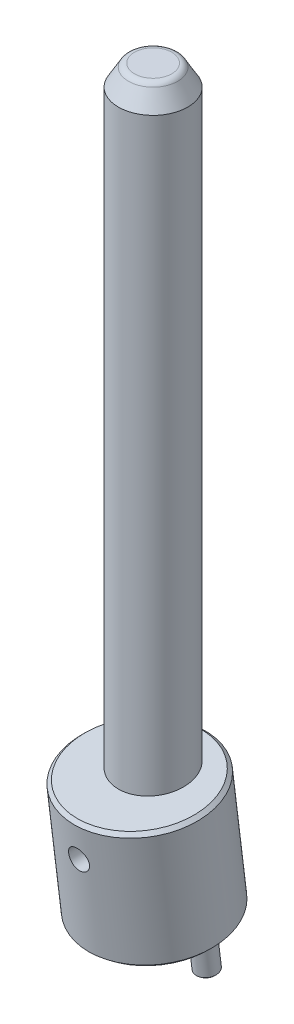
ISO-10303-21;
HEADER;
FILE_DESCRIPTION(('STEP AP214'),'2;1');
FILE_NAME('part.step','',(''),(''),'','','');
FILE_SCHEMA(('AUTOMOTIVE_DESIGN { 1 0 10303 214 1 1 1 1 }'));
ENDSEC;
DATA;
#1=APPLICATION_CONTEXT('core data for automotive mechanical design processes');
#2=APPLICATION_PROTOCOL_DEFINITION('international standard','automotive_design',2000,#1);
#3=PRODUCT_CONTEXT('',#1,'mechanical');
#4=PRODUCT('Part','Part','',(#3));
#5=PRODUCT_RELATED_PRODUCT_CATEGORY('part','',(#4));
#6=PRODUCT_DEFINITION_FORMATION('','',#4);
#7=PRODUCT_DEFINITION_CONTEXT('part definition',#1,'design');
#8=PRODUCT_DEFINITION('design','',#6,#7);
#9=PRODUCT_DEFINITION_SHAPE('','',#8);
#10=(LENGTH_UNIT() NAMED_UNIT(*) SI_UNIT(.MILLI.,.METRE.));
#11=(NAMED_UNIT(*) PLANE_ANGLE_UNIT() SI_UNIT($,.RADIAN.));
#12=(NAMED_UNIT(*) SI_UNIT($,.STERADIAN.) SOLID_ANGLE_UNIT());
#13=UNCERTAINTY_MEASURE_WITH_UNIT(LENGTH_MEASURE(1.E-05),#10,'distance_accuracy_value','');
#14=(GEOMETRIC_REPRESENTATION_CONTEXT(3) GLOBAL_UNCERTAINTY_ASSIGNED_CONTEXT((#13)) GLOBAL_UNIT_ASSIGNED_CONTEXT((#10,
#11,#12)) REPRESENTATION_CONTEXT('',''));
#15=CARTESIAN_POINT('',(0.,0.,0.));
#16=DIRECTION('',(0.,0.,1.));
#17=DIRECTION('',(1.,0.,0.));
#18=AXIS2_PLACEMENT_3D('',#15,#16,#17);
#19=CARTESIAN_POINT('',(0.,205.,0.));
#20=DIRECTION('',(0.,1.,0.));
#21=DIRECTION('',(-1.,0.,0.));
#22=AXIS2_PLACEMENT_3D('',#19,#20,#21);
#23=PLANE('',#22);
#24=CARTESIAN_POINT('',(0.,205.,0.));
#25=DIRECTION('',(0.,-1.,0.));
#26=DIRECTION('',(0.,0.,-1.));
#27=AXIS2_PLACEMENT_3D('',#24,#25,#26);
#28=CIRCLE('',#27,5.381197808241);
#29=CARTESIAN_POINT('',(0.,205.,-5.3811978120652));
#30=VERTEX_POINT('',#29);
#31=CARTESIAN_POINT('',(0.,205.,5.3811978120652));
#32=VERTEX_POINT('',#31);
#33=EDGE_CURVE('P0_E38',#30,#32,#28,.T.);
#34=ORIENTED_EDGE('',*,*,#33,.F.);
#35=CARTESIAN_POINT('',(0.,205.,0.));
#36=DIRECTION('',(0.,-1.,0.));
#37=DIRECTION('',(0.,0.,1.));
#38=AXIS2_PLACEMENT_3D('',#35,#36,#37);
#39=CIRCLE('',#38,5.381197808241);
#40=EDGE_CURVE('P0_E42',#32,#30,#39,.T.);
#41=ORIENTED_EDGE('',*,*,#40,.F.);
#42=EDGE_LOOP('',(#34,#41));
#43=FACE_BOUND('',#42,.T.);
#44=ADVANCED_FACE('P0_F17',(#43),#23,.T.);
#45=CARTESIAN_POINT('',(0.,203.,0.));
#46=DIRECTION('',(0.,1.,0.));
#47=DIRECTION('',(0.00894115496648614,0.,0.999960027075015));
#48=AXIS2_PLACEMENT_3D('',#45,#46,#47);
#49=TOROIDAL_SURFACE('',#48,5.381197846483,2.);
#50=ORIENTED_EDGE('',*,*,#33,.T.);
#51=ORIENTED_EDGE('',*,*,#40,.T.);
#52=EDGE_LOOP('',(#50,#51));
#53=FACE_BOUND('',#52,.T.);
#54=CARTESIAN_POINT('',(0.,204.00000003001,0.));
#55=DIRECTION('',(0.,-1.,0.));
#56=DIRECTION('',(0.,0.,1.));
#57=AXIS2_PLACEMENT_3D('',#54,#55,#56);
#58=CIRCLE('',#57,7.11324863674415);
#59=CARTESIAN_POINT('',(0.,204.00000003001,7.11324863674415));
#60=VERTEX_POINT('',#59);
#61=EDGE_CURVE('P0_E48',#60,#60,#58,.T.);
#62=ORIENTED_EDGE('',*,*,#61,.F.);
#63=EDGE_LOOP('',(#62));
#64=FACE_BOUND('',#63,.T.);
#65=ADVANCED_FACE('P0_F40',(#53,#64),#49,.T.);
#66=CARTESIAN_POINT('',(0.,0.,0.));
#67=DIRECTION('',(0.,1.,0.));
#68=DIRECTION('',(-1.,0.,0.));
#69=AXIS2_PLACEMENT_3D('',#66,#67,#68);
#70=PLANE('',#69);
#71=CARTESIAN_POINT('',(0.,-1.88036588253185E-07,0.));
#72=DIRECTION('',(0.,1.,0.));
#73=DIRECTION('',(-1.,0.,0.));
#74=AXIS2_PLACEMENT_3D('',#71,#72,#73);
#75=CIRCLE('',#74,8.99999984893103);
#76=CARTESIAN_POINT('',(-8.99999984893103,-1.88036588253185E-07,0.));
#77=VERTEX_POINT('',#76);
#78=EDGE_CURVE('P0_E85',#77,#77,#75,.T.);
#79=ORIENTED_EDGE('',*,*,#78,.F.);
#80=EDGE_LOOP('',(#79));
#81=FACE_BOUND('',#80,.T.);
#82=ADVANCED_FACE('P0_F76',(#81),#70,.F.);
#83=CARTESIAN_POINT('',(0.,17.,3.73205080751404));
#84=DIRECTION('',(0.,0.,1.));
#85=DIRECTION('',(-1.,0.,0.));
#86=AXIS2_PLACEMENT_3D('',#83,#84,#85);
#87=CONICAL_SURFACE('',#86,2.99999999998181,1.04719755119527);
#88=CARTESIAN_POINT('',(0.,16.9999999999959,1.99999999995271));
#89=VERTEX_POINT('',#88);
#90=VERTEX_LOOP('',#89);
#91=FACE_BOUND('',#90,.T.);
#92=CARTESIAN_POINT('',(0.,17.,3.732050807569));
#93=DIRECTION('',(0.,0.,1.));
#94=DIRECTION('',(0.,-1.,0.));
#95=AXIS2_PLACEMENT_3D('',#92,#93,#94);
#96=CIRCLE('',#95,3.);
#97=CARTESIAN_POINT('',(0.,14.,3.732050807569));
#98=VERTEX_POINT('',#97);
#99=EDGE_CURVE('P0_E82',#98,#98,#96,.T.);
#100=ORIENTED_EDGE('',*,*,#99,.T.);
#101=EDGE_LOOP('',(#100));
#102=FACE_BOUND('',#101,.T.);
#103=ADVANCED_FACE('P0_F116',(#91,#102),#87,.F.);
#104=CARTESIAN_POINT('',(0.,199.000000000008,0.));
#105=DIRECTION('',(0.,-1.,0.));
#106=DIRECTION('',(1.,0.,0.));
#107=AXIS2_PLACEMENT_3D('',#104,#105,#106);
#108=CONICAL_SURFACE('',#107,10.0000000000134,0.5235987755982);
#109=CARTESIAN_POINT('',(0.,199.,0.));
#110=DIRECTION('',(0.,1.,0.));
#111=DIRECTION('',(-1.,0.,0.));
#112=AXIS2_PLACEMENT_3D('',#109,#110,#111);
#113=CIRCLE('',#112,10.);
#114=CARTESIAN_POINT('',(-10.,199.,0.));
#115=VERTEX_POINT('',#114);
#116=EDGE_CURVE('P0_E92',#115,#115,#113,.F.);
#117=ORIENTED_EDGE('',*,*,#116,.F.);
#118=EDGE_LOOP('',(#117));
#119=FACE_BOUND('',#118,.T.);
#120=ORIENTED_EDGE('',*,*,#61,.T.);
#121=EDGE_LOOP('',(#120));
#122=FACE_BOUND('',#121,.T.);
#123=ADVANCED_FACE('P0_F108',(#119,#122),#108,.T.);
#124=CARTESIAN_POINT('',(0.,1.00000016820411,0.));
#125=DIRECTION('',(0.,1.,0.));
#126=DIRECTION('',(-1.,0.,0.));
#127=AXIS2_PLACEMENT_3D('',#124,#125,#126);
#128=CONICAL_SURFACE('',#127,10.0000002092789,0.785398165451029);
#129=CARTESIAN_POINT('',(0.,1.000000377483,0.));
#130=DIRECTION('',(0.,1.,0.));
#131=DIRECTION('',(-1.,0.,0.));
#132=AXIS2_PLACEMENT_3D('',#129,#130,#131);
#133=CIRCLE('',#132,10.);
#134=CARTESIAN_POINT('',(-10.,1.000000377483,0.));
#135=VERTEX_POINT('',#134);
#136=EDGE_CURVE('P0_E28',#135,#135,#133,.T.);
#137=ORIENTED_EDGE('',*,*,#136,.F.);
#138=EDGE_LOOP('',(#137));
#139=FACE_BOUND('',#138,.T.);
#140=ORIENTED_EDGE('',*,*,#78,.T.);
#141=EDGE_LOOP('',(#140));
#142=FACE_BOUND('',#141,.T.);
#143=ADVANCED_FACE('P0_F105',(#139,#142),#128,.T.);
#144=CARTESIAN_POINT('',(0.,17.,1.5));
#145=DIRECTION('',(0.,0.,1.));
#146=DIRECTION('',(0.,-1.,0.));
#147=AXIS2_PLACEMENT_3D('',#144,#145,#146);
#148=CYLINDRICAL_SURFACE('',#147,3.);
#149=ORIENTED_EDGE('',*,*,#99,.F.);
#150=EDGE_LOOP('',(#149));
#151=FACE_BOUND('',#150,.T.);
#152=CARTESIAN_POINT('',(0.,14.,10.));
#153=CARTESIAN_POINT('',(-0.164364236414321,14.0000089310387,9.99999407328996));
#154=CARTESIAN_POINT('',(-0.328908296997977,14.0135695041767,9.99590322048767));
#155=CARTESIAN_POINT('',(-0.653366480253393,14.0673818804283,9.9799606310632));
#156=CARTESIAN_POINT('',(-0.813271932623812,14.1076806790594,9.96809523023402));
#157=CARTESIAN_POINT('',(-1.12348315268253,14.2135007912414,9.93790838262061));
#158=CARTESIAN_POINT('',(-1.27380789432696,14.2789703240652,9.91960019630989));
#159=CARTESIAN_POINT('',(-1.56129290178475,14.4330996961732,9.87843514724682));
#160=CARTESIAN_POINT('',(-1.69845550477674,14.5217554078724,9.85557909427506));
#161=CARTESIAN_POINT('',(-1.95973946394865,14.7224452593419,9.80701539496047));
#162=CARTESIAN_POINT('',(-2.08342924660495,14.8350271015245,9.78124907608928));
#163=CARTESIAN_POINT('',(-2.31049290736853,15.0792112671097,9.73011807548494));
#164=CARTESIAN_POINT('',(-2.41386225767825,15.2108178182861,9.70475348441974));
#165=CARTESIAN_POINT('',(-2.59960101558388,15.4929419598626,9.65668220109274));
#166=CARTESIAN_POINT('',(-2.68144668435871,15.6438178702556,9.63404799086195));
#167=CARTESIAN_POINT('',(-2.81842825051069,15.9579795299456,9.59487230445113));
#168=CARTESIAN_POINT('',(-2.87357072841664,16.1212622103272,9.57832932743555));
#169=CARTESIAN_POINT('',(-2.95403265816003,16.4507804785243,9.5538174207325));
#170=CARTESIAN_POINT('',(-2.98014390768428,16.6168053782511,9.54562139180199));
#171=CARTESIAN_POINT('',(-3.00427461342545,16.9510662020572,9.53805579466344));
#172=CARTESIAN_POINT('',(-3.00230085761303,17.1193015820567,9.53868409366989));
#173=CARTESIAN_POINT('',(-2.9709395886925,17.4467673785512,9.54849486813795));
#174=CARTESIAN_POINT('',(-2.94254427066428,17.6061036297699,9.55736772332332));
#175=CARTESIAN_POINT('',(-2.86074869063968,17.9176387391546,9.58216703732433));
#176=CARTESIAN_POINT('',(-2.80734582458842,18.0698368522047,9.59809423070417));
#177=CARTESIAN_POINT('',(-2.67631861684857,18.3652051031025,9.6354552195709));
#178=CARTESIAN_POINT('',(-2.59837186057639,18.5082226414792,9.65696160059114));
#179=CARTESIAN_POINT('',(-2.42069837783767,18.7794716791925,9.70302119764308));
#180=CARTESIAN_POINT('',(-2.32096766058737,18.9077004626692,9.7275749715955));
#181=CARTESIAN_POINT('',(-2.09764727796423,19.1513495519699,9.77821549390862));
#182=CARTESIAN_POINT('',(-1.97323765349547,19.2660150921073,9.80432352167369));
#183=CARTESIAN_POINT('',(-1.7065766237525,19.4730741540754,9.85423611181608));
#184=CARTESIAN_POINT('',(-1.56431758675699,19.5654580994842,9.87803968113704));
#185=CARTESIAN_POINT('',(-1.26458300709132,19.7257915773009,9.92088257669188));
#186=CARTESIAN_POINT('',(-1.10700242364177,19.7935547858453,9.93988525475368));
#187=CARTESIAN_POINT('',(-0.782158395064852,19.9012737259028,9.97069163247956));
#188=CARTESIAN_POINT('',(-0.61491570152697,19.9412868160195,9.9825101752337));
#189=CARTESIAN_POINT('',(-0.371824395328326,19.9778051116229,9.99335985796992));
#190=CARTESIAN_POINT('',(-0.297737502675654,19.9861188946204,9.99584304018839));
#191=CARTESIAN_POINT('',(-0.14911274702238,19.9972183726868,9.99916445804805));
#192=CARTESIAN_POINT('',(-0.0745748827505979,20.000004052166,10.0000026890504));
#193=CARTESIAN_POINT('',(0.164364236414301,19.9999910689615,9.99999407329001));
#194=CARTESIAN_POINT('',(0.328908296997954,19.9864304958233,9.99590322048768));
#195=CARTESIAN_POINT('',(0.653366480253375,19.9326181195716,9.97996063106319));
#196=CARTESIAN_POINT('',(0.813271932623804,19.8923193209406,9.96809523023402));
#197=CARTESIAN_POINT('',(1.12348315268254,19.7864992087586,9.93790838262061));
#198=CARTESIAN_POINT('',(1.27380789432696,19.7210296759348,9.91960019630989));
#199=CARTESIAN_POINT('',(1.56129290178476,19.5669003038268,9.87843514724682));
#200=CARTESIAN_POINT('',(1.69845550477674,19.4782445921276,9.85557909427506));
#201=CARTESIAN_POINT('',(1.95973946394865,19.2775547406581,9.80701539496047));
#202=CARTESIAN_POINT('',(2.08342924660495,19.1649728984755,9.78124907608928));
#203=CARTESIAN_POINT('',(2.31049290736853,18.9207887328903,9.73011807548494));
#204=CARTESIAN_POINT('',(2.41386225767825,18.7891821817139,9.70475348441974));
#205=CARTESIAN_POINT('',(2.59960101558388,18.5070580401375,9.65668220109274));
#206=CARTESIAN_POINT('',(2.68144668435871,18.3561821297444,9.63404799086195));
#207=CARTESIAN_POINT('',(2.81842825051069,18.0420204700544,9.59487230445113));
#208=CARTESIAN_POINT('',(2.87357072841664,17.8787377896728,9.57832932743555));
#209=CARTESIAN_POINT('',(2.95403265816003,17.5492195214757,9.5538174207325));
#210=CARTESIAN_POINT('',(2.98014390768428,17.3831946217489,9.54562139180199));
#211=CARTESIAN_POINT('',(3.00427461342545,17.0489337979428,9.53805579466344));
#212=CARTESIAN_POINT('',(3.00230085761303,16.8806984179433,9.53868409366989));
#213=CARTESIAN_POINT('',(2.9709395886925,16.5532326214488,9.54849486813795));
#214=CARTESIAN_POINT('',(2.94254427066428,16.3938963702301,9.55736772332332));
#215=CARTESIAN_POINT('',(2.86074869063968,16.0823612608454,9.58216703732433));
#216=CARTESIAN_POINT('',(2.80734582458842,15.9301631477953,9.59809423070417));
#217=CARTESIAN_POINT('',(2.67631861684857,15.6347948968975,9.6354552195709));
#218=CARTESIAN_POINT('',(2.59837186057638,15.4917773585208,9.65696160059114));
#219=CARTESIAN_POINT('',(2.42069837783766,15.2205283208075,9.70302119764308));
#220=CARTESIAN_POINT('',(2.32096766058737,15.0922995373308,9.7275749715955));
#221=CARTESIAN_POINT('',(2.09764727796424,14.8486504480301,9.77821549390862));
#222=CARTESIAN_POINT('',(1.97323765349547,14.7339849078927,9.80432352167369));
#223=CARTESIAN_POINT('',(1.7065766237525,14.5269258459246,9.85423611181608));
#224=CARTESIAN_POINT('',(1.56431758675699,14.4345419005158,9.87803968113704));
#225=CARTESIAN_POINT('',(1.26458300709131,14.2742084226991,9.92088257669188));
#226=CARTESIAN_POINT('',(1.10700242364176,14.2064452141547,9.93988525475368));
#227=CARTESIAN_POINT('',(0.782158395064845,14.0987262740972,9.97069163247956));
#228=CARTESIAN_POINT('',(0.614915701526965,14.0587131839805,9.9825101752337));
#229=CARTESIAN_POINT('',(0.371824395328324,14.0221948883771,9.99335985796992));
#230=CARTESIAN_POINT('',(0.297737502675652,14.0138811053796,9.9958430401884));
#231=CARTESIAN_POINT('',(0.149112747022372,14.0027816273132,9.99916445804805));
#232=CARTESIAN_POINT('',(0.0745748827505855,13.999995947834,10.0000026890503));
#233=CARTESIAN_POINT('',(0.,14.,10.));
#234=B_SPLINE_CURVE_WITH_KNOTS('',3,(#152,#153,#154,#155,#156,#157,#158,#159,#160,#161,#162,
#163,#164,#165,#166,#167,#168,#169,#170,#171,#172,#173,#174,#175,#176,#177,#178,#179,#180,#181,
#182,#183,#184,#185,#186,#187,#188,#189,#190,#191,#192,#193,#194,#195,#196,#197,#198,#199,#200,
#201,#202,#203,#204,#205,#206,#207,#208,#209,#210,#211,#212,#213,#214,#215,#216,#217,#218,#219,
#220,#221,#222,#223,#224,#225,#226,#227,#228,#229,#230,#231,#232,#233),.UNSPECIFIED.,.T.,.F.,(4,
2,2,2,2,2,2,2,2,2,2,2,2,2,2,2,2,2,2,2,2,2,2,2,2,2,2,2,2,2,2,2,2,2,2,2,2,2,2,2,4),(0.,
0.49280574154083,0.98647994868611,1.47914396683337,1.97172034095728,2.47709830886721,
2.98258875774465,3.49943124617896,4.01614630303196,4.51839363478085,5.02051957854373,
5.50451902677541,5.98856888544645,6.47926306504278,6.97004721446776,7.48124851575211,
7.99266913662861,8.507883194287,9.02202912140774,9.24562293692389,9.4692173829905,
9.96202312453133,10.4556973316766,10.9483613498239,11.4409377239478,11.9463156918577,
12.4518061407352,12.9686486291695,13.4853636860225,13.9876110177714,14.4897369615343,
14.9737364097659,15.457786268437,15.9484804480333,16.4392645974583,16.9504658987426,
17.4618865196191,17.9771005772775,18.4912465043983,18.7148403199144,18.938434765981),.UNSPECIFIED.);
#235=CARTESIAN_POINT('',(0.,14.,10.));
#236=VERTEX_POINT('',#235);
#237=EDGE_CURVE('P0_E11',#236,#236,#234,.T.);
#238=ORIENTED_EDGE('',*,*,#237,.F.);
#239=EDGE_LOOP('',(#238));
#240=FACE_BOUND('',#239,.T.);
#241=ADVANCED_FACE('P0_F107',(#151,#240),#148,.F.);
#242=CARTESIAN_POINT('',(0.,-10.25,0.));
#243=DIRECTION('',(0.,1.,0.));
#244=DIRECTION('',(-1.,0.,0.));
#245=AXIS2_PLACEMENT_3D('',#242,#243,#244);
#246=CYLINDRICAL_SURFACE('',#245,10.);
#247=ORIENTED_EDGE('',*,*,#116,.T.);
#248=EDGE_LOOP('',(#247));
#249=FACE_BOUND('',#248,.T.);
#250=ORIENTED_EDGE('',*,*,#136,.T.);
#251=EDGE_LOOP('',(#250));
#252=FACE_BOUND('',#251,.T.);
#253=ORIENTED_EDGE('',*,*,#237,.T.);
#254=EDGE_LOOP('',(#253));
#255=FACE_BOUND('',#254,.T.);
#256=ADVANCED_FACE('P0_F102',(#249,#252,#255),#246,.T.);
#257=CLOSED_SHELL('',(#44,#65,#82,#103,#123,#143,#241,#256));
#258=MANIFOLD_SOLID_BREP('P0_B1',#257);
#259=CARTESIAN_POINT('',(0.,-15.1520541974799,-1.51393584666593));
#260=DIRECTION('',(0.,-0.992546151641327,-0.121869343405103));
#261=DIRECTION('',(0.,0.121869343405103,-0.992546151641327));
#262=AXIS2_PLACEMENT_3D('',#259,#260,#261);
#263=PLANE('',#262);
#264=CARTESIAN_POINT('',(-14.,-15.1520541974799,-1.51393584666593));
#265=DIRECTION('',(0.,-0.992546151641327,-0.121869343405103));
#266=DIRECTION('',(0.,0.121869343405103,-0.992546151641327));
#267=AXIS2_PLACEMENT_3D('',#264,#265,#266);
#268=CIRCLE('',#267,2.49998893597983);
#269=CARTESIAN_POINT('',(-14.,-14.8473821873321,-3.99529024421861));
#270=VERTEX_POINT('',#269);
#271=EDGE_CURVE('P1_E17',#270,#270,#268,.F.);
#272=ORIENTED_EDGE('',*,*,#271,.F.);
#273=EDGE_LOOP('',(#272));
#274=FACE_BOUND('',#273,.T.);
#275=ADVANCED_FACE('P1_F14',(#274),#263,.T.);
#276=CARTESIAN_POINT('',(0.,-15.1520541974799,-1.51393584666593));
#277=DIRECTION('',(0.,-0.992546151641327,-0.121869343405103));
#278=DIRECTION('',(0.,0.121869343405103,-0.992546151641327));
#279=AXIS2_PLACEMENT_3D('',#276,#277,#278);
#280=PLANE('',#279);
#281=CARTESIAN_POINT('',(14.,-15.1520541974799,-1.51393584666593));
#282=DIRECTION('',(0.,-0.992546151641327,-0.121869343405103));
#283=DIRECTION('',(0.,0.121869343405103,-0.992546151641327));
#284=AXIS2_PLACEMENT_3D('',#281,#282,#283);
#285=CIRCLE('',#284,2.49998893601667);
#286=CARTESIAN_POINT('',(14.,-14.8473821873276,-3.99529024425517));
#287=VERTEX_POINT('',#286);
#288=EDGE_CURVE('P1_E114',#287,#287,#285,.F.);
#289=ORIENTED_EDGE('',*,*,#288,.F.);
#290=EDGE_LOOP('',(#289));
#291=FACE_BOUND('',#290,.T.);
#292=ADVANCED_FACE('P1_F104',(#291),#280,.T.);
#293=CARTESIAN_POINT('',(0.,-1.32706345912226E-13,-3.20815422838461E-13));
#294=DIRECTION('',(0.,-1.,0.));
#295=DIRECTION('',(0.,0.,-1.));
#296=AXIS2_PLACEMENT_3D('',#293,#294,#295);
#297=PLANE('',#296);
#298=CARTESIAN_POINT('',(0.,0.,-2.03098171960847E-12));
#299=DIRECTION('',(0.,-1.,0.));
#300=DIRECTION('',(0.,0.,-1.));
#301=AXIS2_PLACEMENT_3D('',#298,#299,#300);
#302=CIRCLE('',#301,10.);
#303=CARTESIAN_POINT('',(0.,0.,-10.000000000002));
#304=VERTEX_POINT('',#303);
#305=EDGE_CURVE('P1_E116',#304,#304,#302,.F.);
#306=ORIENTED_EDGE('',*,*,#305,.T.);
#307=EDGE_LOOP('',(#306));
#308=FACE_BOUND('',#307,.T.);
#309=ADVANCED_FACE('P1_F101',(#308),#297,.F.);
#310=CARTESIAN_POINT('',(-14.,-14.6557726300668,-1.45300013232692));
#311=DIRECTION('',(0.,0.992546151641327,0.121869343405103));
#312=DIRECTION('',(0.,-0.121869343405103,0.992546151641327));
#313=AXIS2_PLACEMENT_3D('',#310,#311,#312);
#314=CONICAL_SURFACE('',#313,2.99999527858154,0.785395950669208);
#315=CARTESIAN_POINT('',(-14.,-14.6557679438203,-1.4529995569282));
#316=DIRECTION('',(0.,0.992546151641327,0.121869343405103));
#317=DIRECTION('',(0.,-0.121869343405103,0.992546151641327));
#318=AXIS2_PLACEMENT_3D('',#315,#316,#317);
#319=CIRCLE('',#318,3.);
#320=CARTESIAN_POINT('',(-14.,-15.0213759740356,1.52463889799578));
#321=VERTEX_POINT('',#320);
#322=EDGE_CURVE('P1_E118',#321,#321,#319,.T.);
#323=ORIENTED_EDGE('',*,*,#322,.F.);
#324=EDGE_LOOP('',(#323));
#325=FACE_BOUND('',#324,.T.);
#326=ORIENTED_EDGE('',*,*,#271,.T.);
#327=EDGE_LOOP('',(#326));
#328=FACE_BOUND('',#327,.T.);
#329=ADVANCED_FACE('P1_F97',(#325,#328),#314,.T.);
#330=CARTESIAN_POINT('',(14.,-14.6557726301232,-1.45300013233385));
#331=DIRECTION('',(0.,0.992546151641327,0.121869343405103));
#332=DIRECTION('',(0.,-0.121869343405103,0.992546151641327));
#333=AXIS2_PLACEMENT_3D('',#330,#331,#332);
#334=CONICAL_SURFACE('',#333,2.99999527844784,0.785395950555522);
#335=CARTESIAN_POINT('',(14.,-14.655767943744,-1.45299955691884));
#336=DIRECTION('',(0.,0.992546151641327,0.121869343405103));
#337=DIRECTION('',(0.,-0.121869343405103,0.992546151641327));
#338=AXIS2_PLACEMENT_3D('',#335,#336,#337);
#339=CIRCLE('',#338,3.);
#340=CARTESIAN_POINT('',(14.,-15.0213759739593,1.52463889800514));
#341=VERTEX_POINT('',#340);
#342=EDGE_CURVE('P1_E123',#341,#341,#339,.T.);
#343=ORIENTED_EDGE('',*,*,#342,.F.);
#344=EDGE_LOOP('',(#343));
#345=FACE_BOUND('',#344,.T.);
#346=ORIENTED_EDGE('',*,*,#288,.T.);
#347=EDGE_LOOP('',(#346));
#348=FACE_BOUND('',#347,.T.);
#349=ADVANCED_FACE('P1_F92',(#345,#348),#334,.T.);
#350=CARTESIAN_POINT('',(0.,43.3305704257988,-2.03092750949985E-12));
#351=DIRECTION('',(0.,-1.,0.));
#352=DIRECTION('',(0.,0.,-1.));
#353=AXIS2_PLACEMENT_3D('',#350,#351,#352);
#354=CYLINDRICAL_SURFACE('',#353,10.);
#355=CARTESIAN_POINT('',(0.,30.0000000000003,-2.03092750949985E-12));
#356=DIRECTION('',(0.,0.992546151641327,0.121869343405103));
#357=DIRECTION('',(0.,-0.121869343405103,0.992546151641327));
#358=AXIS2_PLACEMENT_3D('',#355,#356,#357);
#359=ELLIPSE('',#358,10.0750982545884,10.);
#360=CARTESIAN_POINT('',(0.,28.7721543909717,9.99999999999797));
#361=VERTEX_POINT('',#360);
#362=EDGE_CURVE('P1_E79',#361,#361,#359,.F.);
#363=ORIENTED_EDGE('',*,*,#362,.F.);
#364=EDGE_LOOP('',(#363));
#365=FACE_BOUND('',#364,.T.);
#366=ORIENTED_EDGE('',*,*,#305,.F.);
#367=EDGE_LOOP('',(#366));
#368=FACE_BOUND('',#367,.T.);
#369=CARTESIAN_POINT('',(0.,20.0000000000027,9.99999999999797));
#370=CARTESIAN_POINT('',(-0.16436423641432,19.999991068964,9.99999407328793));
#371=CARTESIAN_POINT('',(-0.328908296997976,19.986430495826,9.99590322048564));
#372=CARTESIAN_POINT('',(-0.653366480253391,19.9326181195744,9.97996063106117));
#373=CARTESIAN_POINT('',(-0.81327193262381,19.8923193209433,9.96809523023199));
#374=CARTESIAN_POINT('',(-1.12348315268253,19.7864992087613,9.93790838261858));
#375=CARTESIAN_POINT('',(-1.27380789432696,19.7210296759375,9.91960019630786));
#376=CARTESIAN_POINT('',(-1.56129290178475,19.5669003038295,9.87843514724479));
#377=CARTESIAN_POINT('',(-1.69845550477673,19.4782445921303,9.85557909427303));
#378=CARTESIAN_POINT('',(-1.95973946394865,19.2775547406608,9.80701539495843));
#379=CARTESIAN_POINT('',(-2.08342924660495,19.1649728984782,9.78124907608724));
#380=CARTESIAN_POINT('',(-2.31049290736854,18.920788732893,9.73011807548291));
#381=CARTESIAN_POINT('',(-2.41386225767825,18.7891821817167,9.70475348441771));
#382=CARTESIAN_POINT('',(-2.59960101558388,18.5070580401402,9.65668220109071));
#383=CARTESIAN_POINT('',(-2.68144668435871,18.3561821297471,9.63404799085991));
#384=CARTESIAN_POINT('',(-2.81842825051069,18.0420204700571,9.5948723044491));
#385=CARTESIAN_POINT('',(-2.87357072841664,17.8787377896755,9.57832932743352));
#386=CARTESIAN_POINT('',(-2.95403265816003,17.5492195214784,9.55381742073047));
#387=CARTESIAN_POINT('',(-2.98014390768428,17.3831946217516,9.54562139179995));
#388=CARTESIAN_POINT('',(-3.00427461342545,17.0489337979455,9.53805579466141));
#389=CARTESIAN_POINT('',(-3.00230085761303,16.8806984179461,9.53868409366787));
#390=CARTESIAN_POINT('',(-2.9709395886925,16.5532326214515,9.54849486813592));
#391=CARTESIAN_POINT('',(-2.94254427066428,16.3938963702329,9.55736772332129));
#392=CARTESIAN_POINT('',(-2.86074869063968,16.0823612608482,9.5821670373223));
#393=CARTESIAN_POINT('',(-2.80734582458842,15.9301631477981,9.59809423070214));
#394=CARTESIAN_POINT('',(-2.67631861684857,15.6347948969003,9.63545521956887));
#395=CARTESIAN_POINT('',(-2.59837186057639,15.4917773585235,9.65696160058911));
#396=CARTESIAN_POINT('',(-2.42069837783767,15.2205283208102,9.70302119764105));
#397=CARTESIAN_POINT('',(-2.32096766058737,15.0922995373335,9.72757497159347));
#398=CARTESIAN_POINT('',(-2.09764727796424,14.8486504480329,9.77821549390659));
#399=CARTESIAN_POINT('',(-1.97323765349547,14.7339849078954,9.80432352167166));
#400=CARTESIAN_POINT('',(-1.7065766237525,14.5269258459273,9.85423611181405));
#401=CARTESIAN_POINT('',(-1.56431758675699,14.4345419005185,9.87803968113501));
#402=CARTESIAN_POINT('',(-1.26458300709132,14.2742084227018,9.92088257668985));
#403=CARTESIAN_POINT('',(-1.10700242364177,14.2064452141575,9.93988525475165));
#404=CARTESIAN_POINT('',(-0.782158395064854,14.0987262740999,9.97069163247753));
#405=CARTESIAN_POINT('',(-0.614915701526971,14.0587131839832,9.98251017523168));
#406=CARTESIAN_POINT('',(-0.371824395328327,14.0221948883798,9.99335985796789));
#407=CARTESIAN_POINT('',(-0.297737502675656,14.0138811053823,9.99584304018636));
#408=CARTESIAN_POINT('',(-0.149112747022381,14.0027816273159,9.99916445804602));
#409=CARTESIAN_POINT('',(-0.0745748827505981,13.9999959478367,10.0000026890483));
#410=CARTESIAN_POINT('',(0.164364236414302,14.0000089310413,9.99999407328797));
#411=CARTESIAN_POINT('',(0.328908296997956,14.0135695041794,9.99590322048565));
#412=CARTESIAN_POINT('',(0.653366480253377,14.0673818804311,9.97996063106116));
#413=CARTESIAN_POINT('',(0.813271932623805,14.1076806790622,9.96809523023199));
#414=CARTESIAN_POINT('',(1.12348315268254,14.2135007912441,9.93790838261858));
#415=CARTESIAN_POINT('',(1.27380789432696,14.2789703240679,9.91960019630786));
#416=CARTESIAN_POINT('',(1.56129290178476,14.4330996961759,9.87843514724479));
#417=CARTESIAN_POINT('',(1.69845550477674,14.5217554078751,9.85557909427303));
#418=CARTESIAN_POINT('',(1.95973946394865,14.7224452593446,9.80701539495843));
#419=CARTESIAN_POINT('',(2.08342924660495,14.8350271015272,9.78124907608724));
#420=CARTESIAN_POINT('',(2.31049290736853,15.0792112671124,9.73011807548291));
#421=CARTESIAN_POINT('',(2.41386225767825,15.2108178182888,9.70475348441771));
#422=CARTESIAN_POINT('',(2.59960101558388,15.4929419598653,9.65668220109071));
#423=CARTESIAN_POINT('',(2.68144668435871,15.6438178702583,9.63404799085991));
#424=CARTESIAN_POINT('',(2.81842825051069,15.9579795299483,9.5948723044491));
#425=CARTESIAN_POINT('',(2.87357072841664,16.1212622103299,9.57832932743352));
#426=CARTESIAN_POINT('',(2.95403265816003,16.450780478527,9.55381742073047));
#427=CARTESIAN_POINT('',(2.98014390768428,16.6168053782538,9.54562139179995));
#428=CARTESIAN_POINT('',(3.00427461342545,16.9510662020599,9.53805579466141));
#429=CARTESIAN_POINT('',(3.00230085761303,17.1193015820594,9.53868409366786));
#430=CARTESIAN_POINT('',(2.9709395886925,17.4467673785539,9.54849486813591));
#431=CARTESIAN_POINT('',(2.94254427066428,17.6061036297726,9.55736772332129));
#432=CARTESIAN_POINT('',(2.86074869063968,17.9176387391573,9.5821670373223));
#433=CARTESIAN_POINT('',(2.80734582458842,18.0698368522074,9.59809423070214));
#434=CARTESIAN_POINT('',(2.67631861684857,18.3652051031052,9.63545521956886));
#435=CARTESIAN_POINT('',(2.59837186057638,18.5082226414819,9.65696160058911));
#436=CARTESIAN_POINT('',(2.42069837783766,18.7794716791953,9.70302119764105));
#437=CARTESIAN_POINT('',(2.32096766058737,18.9077004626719,9.72757497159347));
#438=CARTESIAN_POINT('',(2.09764727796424,19.1513495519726,9.77821549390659));
#439=CARTESIAN_POINT('',(1.97323765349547,19.26601509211,9.80432352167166));
#440=CARTESIAN_POINT('',(1.7065766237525,19.4730741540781,9.85423611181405));
#441=CARTESIAN_POINT('',(1.56431758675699,19.5654580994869,9.87803968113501));
#442=CARTESIAN_POINT('',(1.26458300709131,19.7257915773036,9.92088257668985));
#443=CARTESIAN_POINT('',(1.10700242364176,19.793554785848,9.93988525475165));
#444=CARTESIAN_POINT('',(0.782158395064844,19.9012737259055,9.97069163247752));
#445=CARTESIAN_POINT('',(0.614915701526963,19.9412868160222,9.98251017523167));
#446=CARTESIAN_POINT('',(0.371824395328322,19.9778051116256,9.99335985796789));
#447=CARTESIAN_POINT('',(0.297737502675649,19.9861188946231,9.99584304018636));
#448=CARTESIAN_POINT('',(0.149112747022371,19.9972183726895,9.99916445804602));
#449=CARTESIAN_POINT('',(0.0745748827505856,20.0000040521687,10.0000026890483));
#450=CARTESIAN_POINT('',(0.,20.0000000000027,9.99999999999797));
#451=B_SPLINE_CURVE_WITH_KNOTS('',3,(#369,#370,#371,#372,#373,#374,#375,#376,#377,#378,#379,
#380,#381,#382,#383,#384,#385,#386,#387,#388,#389,#390,#391,#392,#393,#394,#395,#396,#397,#398,
#399,#400,#401,#402,#403,#404,#405,#406,#407,#408,#409,#410,#411,#412,#413,#414,#415,#416,#417,
#418,#419,#420,#421,#422,#423,#424,#425,#426,#427,#428,#429,#430,#431,#432,#433,#434,#435,#436,
#437,#438,#439,#440,#441,#442,#443,#444,#445,#446,#447,#448,#449,#450),.UNSPECIFIED.,.T.,.F.,(4,
2,2,2,2,2,2,2,2,2,2,2,2,2,2,2,2,2,2,2,2,2,2,2,2,2,2,2,2,2,2,2,2,2,2,2,2,2,2,2,4),(0.,
0.49280574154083,0.986479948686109,1.47914396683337,1.97172034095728,2.47709830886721,
2.98258875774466,3.49943124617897,4.01614630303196,4.51839363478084,5.02051957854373,
5.50451902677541,5.98856888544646,6.47926306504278,6.97004721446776,7.48124851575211,
7.99266913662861,8.507883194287,9.02202912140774,9.24562293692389,9.46921738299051,
9.96202312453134,10.4556973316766,10.9483613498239,11.4409377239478,11.9463156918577,
12.4518061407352,12.9686486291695,13.4853636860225,13.9876110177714,14.4897369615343,
14.9737364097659,15.457786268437,15.9484804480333,16.4392645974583,16.9504658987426,
17.4618865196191,17.9771005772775,18.4912465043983,18.7148403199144,18.9384347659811),.UNSPECIFIED.);
#452=CARTESIAN_POINT('',(0.,20.0000000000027,9.99999999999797));
#453=VERTEX_POINT('',#452);
#454=EDGE_CURVE('P1_E76',#453,#453,#451,.T.);
#455=ORIENTED_EDGE('',*,*,#454,.T.);
#456=EDGE_LOOP('',(#455));
#457=FACE_BOUND('',#456,.T.);
#458=ADVANCED_FACE('P1_F86',(#365,#368,#457),#354,.F.);
#459=CARTESIAN_POINT('',(-14.,-6.219138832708,-0.41711175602));
#460=DIRECTION('',(0.,-0.992546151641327,-0.121869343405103));
#461=DIRECTION('',(0.,0.121869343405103,-0.992546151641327));
#462=AXIS2_PLACEMENT_3D('',#459,#460,#461);
#463=CYLINDRICAL_SURFACE('',#462,3.);
#464=CARTESIAN_POINT('',(-14.,-6.219138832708,-0.41711175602));
#465=DIRECTION('',(0.,-0.992546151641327,-0.121869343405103));
#466=DIRECTION('',(0.,0.121869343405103,-0.992546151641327));
#467=AXIS2_PLACEMENT_3D('',#464,#465,#466);
#468=CIRCLE('',#467,3.);
#469=CARTESIAN_POINT('',(-14.,-5.85353080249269,-3.39475021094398));
#470=VERTEX_POINT('',#469);
#471=EDGE_CURVE('P1_E72',#470,#470,#468,.T.);
#472=ORIENTED_EDGE('',*,*,#471,.T.);
#473=EDGE_LOOP('',(#472));
#474=FACE_BOUND('',#473,.T.);
#475=ORIENTED_EDGE('',*,*,#322,.T.);
#476=EDGE_LOOP('',(#475));
#477=FACE_BOUND('',#476,.T.);
#478=ADVANCED_FACE('P1_F91',(#474,#477),#463,.T.);
#479=CARTESIAN_POINT('',(14.,-6.219138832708,-0.41711175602));
#480=DIRECTION('',(0.,-0.992546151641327,-0.121869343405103));
#481=DIRECTION('',(0.,0.121869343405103,-0.992546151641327));
#482=AXIS2_PLACEMENT_3D('',#479,#480,#481);
#483=CYLINDRICAL_SURFACE('',#482,3.);
#484=CARTESIAN_POINT('',(14.,-6.219138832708,-0.41711175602));
#485=DIRECTION('',(0.,-0.992546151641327,-0.121869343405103));
#486=DIRECTION('',(0.,0.121869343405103,-0.992546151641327));
#487=AXIS2_PLACEMENT_3D('',#484,#485,#486);
#488=CIRCLE('',#487,3.);
#489=CARTESIAN_POINT('',(14.,-5.85353080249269,-3.39475021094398));
#490=VERTEX_POINT('',#489);
#491=EDGE_CURVE('P1_E68',#490,#490,#488,.T.);
#492=ORIENTED_EDGE('',*,*,#491,.T.);
#493=EDGE_LOOP('',(#492));
#494=FACE_BOUND('',#493,.T.);
#495=ORIENTED_EDGE('',*,*,#342,.T.);
#496=EDGE_LOOP('',(#495));
#497=FACE_BOUND('',#496,.T.);
#498=ADVANCED_FACE('P1_F139',(#494,#497),#483,.T.);
#499=CARTESIAN_POINT('',(0.,29.5125226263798,3.97018460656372));
#500=DIRECTION('',(0.,0.992546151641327,0.121869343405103));
#501=DIRECTION('',(0.,-0.121869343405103,0.992546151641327));
#502=AXIS2_PLACEMENT_3D('',#499,#500,#501);
#503=PLANE('',#502);
#504=ORIENTED_EDGE('',*,*,#362,.T.);
#505=EDGE_LOOP('',(#504));
#506=FACE_BOUND('',#505,.T.);
#507=CARTESIAN_POINT('',(0.,29.5125226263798,3.9701846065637));
#508=DIRECTION('',(0.,0.992546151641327,0.121869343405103));
#509=DIRECTION('',(0.,-0.121869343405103,0.992546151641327));
#510=AXIS2_PLACEMENT_3D('',#507,#508,#509);
#511=CIRCLE('',#510,17.9999935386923);
#512=CARTESIAN_POINT('',(0.,27.3188752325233,21.8360089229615));
#513=VERTEX_POINT('',#512);
#514=EDGE_CURVE('P1_E38',#513,#513,#511,.F.);
#515=ORIENTED_EDGE('',*,*,#514,.F.);
#516=EDGE_LOOP('',(#515));
#517=FACE_BOUND('',#516,.T.);
#518=ADVANCED_FACE('P1_F63',(#506,#517),#503,.T.);
#519=CARTESIAN_POINT('',(0.,17.0000000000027,-3.70003727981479));
#520=DIRECTION('',(0.,0.,1.));
#521=DIRECTION('',(0.,-1.,0.));
#522=AXIS2_PLACEMENT_3D('',#519,#520,#521);
#523=CYLINDRICAL_SURFACE('',#522,3.);
#524=ORIENTED_EDGE('',*,*,#454,.F.);
#525=EDGE_LOOP('',(#524));
#526=FACE_BOUND('',#525,.T.);
#527=CARTESIAN_POINT('',(0.,14.0000000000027,21.2081730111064));
#528=CARTESIAN_POINT('',(-0.168375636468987,14.000007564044,21.2081708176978));
#529=CARTESIAN_POINT('',(-0.336958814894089,14.0142312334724,21.2076402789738));
#530=CARTESIAN_POINT('',(-0.669566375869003,14.0707956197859,21.2057130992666));
#531=CARTESIAN_POINT('',(-0.833581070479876,14.1131919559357,21.2043147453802));
#532=CARTESIAN_POINT('',(-1.15205522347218,14.2248959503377,21.2012396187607));
#533=CARTESIAN_POINT('',(-1.30652215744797,14.2941822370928,21.1995630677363));
#534=CARTESIAN_POINT('',(-1.60156617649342,14.4576731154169,21.1968228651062));
#535=CARTESIAN_POINT('',(-1.74214908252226,14.5518672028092,21.1957589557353));
#536=CARTESIAN_POINT('',(-2.00554261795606,14.7625371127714,21.1953276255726));
#537=CARTESIAN_POINT('',(-2.12834999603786,14.8790170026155,21.1959605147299));
#538=CARTESIAN_POINT('',(-2.3526557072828,15.1309218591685,21.2000562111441));
#539=CARTESIAN_POINT('',(-2.45415323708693,15.2663475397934,21.2035191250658));
#540=CARTESIAN_POINT('',(-2.63254643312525,15.551595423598,21.2142654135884));
#541=CARTESIAN_POINT('',(-2.70954499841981,15.7013538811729,21.2215324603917));
#542=CARTESIAN_POINT('',(-2.83737969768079,16.0113712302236,21.2405952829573));
#543=CARTESIAN_POINT('',(-2.88821737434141,16.1716295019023,21.252390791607));
#544=CARTESIAN_POINT('',(-2.96225674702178,16.4972232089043,21.2807457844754));
#545=CARTESIAN_POINT('',(-2.98558245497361,16.6625323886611,21.2972834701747));
#546=CARTESIAN_POINT('',(-3.00459042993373,16.9942055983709,21.3349508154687));
#547=CARTESIAN_POINT('',(-3.00027160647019,17.1605696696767,21.3560806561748));
#548=CARTESIAN_POINT('',(-2.9642365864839,17.4910773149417,21.4024316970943));
#549=CARTESIAN_POINT('',(-2.93230247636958,17.65519265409,21.4276841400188));
#550=CARTESIAN_POINT('',(-2.84186394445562,17.9754520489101,21.4810141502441));
#551=CARTESIAN_POINT('',(-2.78335584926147,18.1315949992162,21.5090921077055));
#552=CARTESIAN_POINT('',(-2.64001667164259,18.4349283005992,21.5671655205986));
#553=CARTESIAN_POINT('',(-2.55467438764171,18.5818719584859,21.5971883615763));
#554=CARTESIAN_POINT('',(-2.36040600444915,18.8593465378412,21.6567869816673));
#555=CARTESIAN_POINT('',(-2.25147933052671,18.9898770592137,21.6863627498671));
#556=CARTESIAN_POINT('',(-2.0116154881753,19.2322107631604,21.7434078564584));
#557=CARTESIAN_POINT('',(-1.88046287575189,19.3438068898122,21.7708523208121));
#558=CARTESIAN_POINT('',(-1.60035758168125,19.5433076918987,21.8213051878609));
#559=CARTESIAN_POINT('',(-1.45139855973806,19.6312038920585,21.8443120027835));
#560=CARTESIAN_POINT('',(-1.14272283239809,19.7790218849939,21.883718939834));
#561=CARTESIAN_POINT('',(-0.983245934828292,19.8394155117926,21.9002297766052));
#562=CARTESIAN_POINT('',(-0.656050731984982,19.9323006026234,21.9258599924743));
#563=CARTESIAN_POINT('',(-0.488353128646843,19.9648586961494,21.9349970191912));
#564=CARTESIAN_POINT('',(-0.266232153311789,19.9886415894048,21.9416818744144));
#565=CARTESIAN_POINT('',(-0.213088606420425,19.992897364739,21.9428794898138));
#566=CARTESIAN_POINT('',(-0.106637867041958,19.9985778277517,21.9444793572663));
#567=CARTESIAN_POINT('',(-0.0533306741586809,20.0000025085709,21.9448816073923));
#568=CARTESIAN_POINT('',(0.164356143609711,19.9999922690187,21.9448765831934));
#569=CARTESIAN_POINT('',(0.328935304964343,19.9864295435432,21.9410406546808));
#570=CARTESIAN_POINT('',(0.653541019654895,19.9325856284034,21.9259781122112));
#571=CARTESIAN_POINT('',(0.813557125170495,19.8922475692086,21.9147357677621));
#572=CARTESIAN_POINT('',(1.12402944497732,19.7862873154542,21.8857527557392));
#573=CARTESIAN_POINT('',(1.27450305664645,19.7207127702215,21.8680243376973));
#574=CARTESIAN_POINT('',(1.56216881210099,19.5663745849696,21.8273798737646));
#575=CARTESIAN_POINT('',(1.69936540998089,19.4776187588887,21.804465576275));
#576=CARTESIAN_POINT('',(1.95987302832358,19.2773770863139,21.7545069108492));
#577=CARTESIAN_POINT('',(2.08283374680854,19.1654547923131,21.7273862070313));
#578=CARTESIAN_POINT('',(2.30845456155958,18.9231375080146,21.6711894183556));
#579=CARTESIAN_POINT('',(2.4111098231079,18.7927381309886,21.6421128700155));
#580=CARTESIAN_POINT('',(2.59623248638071,18.5127945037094,21.5829616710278));
#581=CARTESIAN_POINT('',(2.67802121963,18.3628016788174,21.5528827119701));
#582=CARTESIAN_POINT('',(2.81509396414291,18.0508440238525,21.4944052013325));
#583=CARTESIAN_POINT('',(2.87037734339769,17.8888789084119,21.4660066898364));
#584=CARTESIAN_POINT('',(2.95281854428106,17.5569391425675,21.4123704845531));
#585=CARTESIAN_POINT('',(2.97989932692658,17.3869438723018,21.3871416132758));
#586=CARTESIAN_POINT('',(3.00458761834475,17.0442359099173,21.3410961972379));
#587=CARTESIAN_POINT('',(3.00219875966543,16.8715235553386,21.3202791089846));
#588=CARTESIAN_POINT('',(2.96806290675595,16.53183043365,21.2840404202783));
#589=CARTESIAN_POINT('',(2.93687920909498,16.3648032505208,21.2685230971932));
#590=CARTESIAN_POINT('',(2.84664339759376,16.0380535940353,21.2424022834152));
#591=CARTESIAN_POINT('',(2.7875933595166,15.8783305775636,21.2317984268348));
#592=CARTESIAN_POINT('',(2.64432821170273,15.5732906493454,21.2151852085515));
#593=CARTESIAN_POINT('',(2.56050413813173,15.427793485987,21.2091092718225));
#594=CARTESIAN_POINT('',(2.36973535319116,15.1527418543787,21.2004847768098));
#595=CARTESIAN_POINT('',(2.26279233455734,15.0231862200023,21.1979359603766));
#596=CARTESIAN_POINT('',(2.02876719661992,14.783662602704,21.1953244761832));
#597=CARTESIAN_POINT('',(1.90167888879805,14.6737006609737,21.1952625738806));
#598=CARTESIAN_POINT('',(1.63088940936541,14.4764579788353,21.1965152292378));
#599=CARTESIAN_POINT('',(1.48718067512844,14.3891876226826,21.1978304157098));
#600=CARTESIAN_POINT('',(1.18628909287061,14.2393544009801,21.2008217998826));
#601=CARTESIAN_POINT('',(1.02902570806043,14.1769536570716,21.2025002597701));
#602=CARTESIAN_POINT('',(0.706461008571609,14.0795207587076,21.2053879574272));
#603=CARTESIAN_POINT('',(0.541176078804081,14.0444351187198,21.2065981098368));
#604=CARTESIAN_POINT('',(0.312244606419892,14.0156349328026,21.2076109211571));
#605=CARTESIAN_POINT('',(0.249948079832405,14.0097763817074,21.207820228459));
#606=CARTESIAN_POINT('',(0.125110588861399,14.001957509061,21.2081016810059));
#607=CARTESIAN_POINT('',(0.0625696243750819,13.9999971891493,21.2081738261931));
#608=CARTESIAN_POINT('',(0.,14.0000000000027,21.2081730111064));
#609=B_SPLINE_CURVE_WITH_KNOTS('',3,(#527,#528,#529,#530,#531,#532,#533,#534,#535,#536,#537,
#538,#539,#540,#541,#542,#543,#544,#545,#546,#547,#548,#549,#550,#551,#552,#553,#554,#555,#556,
#557,#558,#559,#560,#561,#562,#563,#564,#565,#566,#567,#568,#569,#570,#571,#572,#573,#574,#575,
#576,#577,#578,#579,#580,#581,#582,#583,#584,#585,#586,#587,#588,#589,#590,#591,#592,#593,#594,
#595,#596,#597,#598,#599,#600,#601,#602,#603,#604,#605,#606,#607,#608),.UNSPECIFIED.,.T.,.F.,(4,
2,2,2,2,2,2,2,2,2,2,2,2,2,2,2,2,2,2,2,2,2,2,2,2,2,2,2,2,2,2,2,2,2,2,2,2,2,2,2,4),(0.,
0.504891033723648,1.0107818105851,1.51627133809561,2.02154802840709,2.52691702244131,
3.03230506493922,3.53554149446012,4.03874824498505,4.53967798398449,5.04062748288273,
5.54556644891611,6.05057523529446,6.56585585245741,7.08114902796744,7.60175733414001,
8.12255156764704,8.63403921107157,9.14429905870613,9.30422329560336,9.46414791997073,
9.95700864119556,10.4509195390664,10.9439024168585,11.4367193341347,11.9398402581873,
12.443080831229,12.9610478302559,13.4790271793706,13.9984177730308,14.5177443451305,
15.0271220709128,15.5364618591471,16.0381563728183,16.5398141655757,17.0416263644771,
17.5436678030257,18.0489304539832,18.5532012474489,18.7408223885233,18.9284436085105),.UNSPECIFIED.);
#610=CARTESIAN_POINT('',(0.,14.0000000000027,21.2081730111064));
#611=VERTEX_POINT('',#610);
#612=EDGE_CURVE('P1_E31',#611,#611,#609,.T.);
#613=ORIENTED_EDGE('',*,*,#612,.F.);
#614=EDGE_LOOP('',(#613));
#615=FACE_BOUND('',#614,.T.);
#616=ADVANCED_FACE('P1_F40',(#526,#615),#523,.F.);
#617=CARTESIAN_POINT('',(0.,-6.219138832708,-0.41711175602));
#618=DIRECTION('',(0.,0.992546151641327,0.121869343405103));
#619=DIRECTION('',(0.,-0.121869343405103,0.992546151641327));
#620=AXIS2_PLACEMENT_3D('',#617,#618,#619);
#621=PLANE('',#620);
#622=ORIENTED_EDGE('',*,*,#491,.F.);
#623=EDGE_LOOP('',(#622));
#624=FACE_BOUND('',#623,.T.);
#625=ORIENTED_EDGE('',*,*,#471,.F.);
#626=EDGE_LOOP('',(#625));
#627=FACE_BOUND('',#626,.T.);
#628=CARTESIAN_POINT('',(0.,-6.219138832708,-0.417111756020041));
#629=DIRECTION('',(0.,0.992546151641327,0.121869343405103));
#630=DIRECTION('',(0.,-0.121869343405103,0.992546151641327));
#631=AXIS2_PLACEMENT_3D('',#628,#629,#630);
#632=CIRCLE('',#631,17.9999934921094);
#633=CARTESIAN_POINT('',(0.,-8.4127862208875,17.448712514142));
#634=VERTEX_POINT('',#633);
#635=EDGE_CURVE('P1_E26',#634,#634,#632,.T.);
#636=ORIENTED_EDGE('',*,*,#635,.F.);
#637=EDGE_LOOP('',(#636));
#638=FACE_BOUND('',#637,.T.);
#639=ADVANCED_FACE('P1_F55',(#624,#627,#638),#621,.F.);
#640=CARTESIAN_POINT('',(0.,28.5199727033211,3.84831480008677));
#641=DIRECTION('',(0.,-0.992546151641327,-0.121869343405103));
#642=DIRECTION('',(0.,0.121869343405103,-0.992546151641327));
#643=AXIS2_PLACEMENT_3D('',#640,#641,#642);
#644=CONICAL_SURFACE('',#643,18.9999969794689,0.785397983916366);
#645=ORIENTED_EDGE('',*,*,#514,.T.);
#646=EDGE_LOOP('',(#645));
#647=FACE_BOUND('',#646,.T.);
#648=CARTESIAN_POINT('',(0.,28.5199757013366,3.84831516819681));
#649=DIRECTION('',(0.,0.992546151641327,0.121869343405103));
#650=DIRECTION('',(0.,-0.121869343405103,0.992546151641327));
#651=AXIS2_PLACEMENT_3D('',#648,#649,#650);
#652=CIRCLE('',#651,19.);
#653=CARTESIAN_POINT('',(0.,26.2044581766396,22.706692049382));
#654=VERTEX_POINT('',#653);
#655=EDGE_CURVE('P1_E21',#654,#654,#652,.F.);
#656=ORIENTED_EDGE('',*,*,#655,.F.);
#657=EDGE_LOOP('',(#656));
#658=FACE_BOUND('',#657,.T.);
#659=ADVANCED_FACE('P1_F52',(#647,#658),#644,.T.);
#660=CARTESIAN_POINT('',(0.,-5.22658879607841,-0.295241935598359));
#661=DIRECTION('',(0.,0.992546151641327,0.121869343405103));
#662=DIRECTION('',(0.,-0.121869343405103,0.992546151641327));
#663=AXIS2_PLACEMENT_3D('',#660,#661,#662);
#664=CONICAL_SURFACE('',#663,18.9999970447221,0.785397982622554);
#665=CARTESIAN_POINT('',(0.,-5.22659172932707,-0.295242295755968));
#666=DIRECTION('',(0.,0.992546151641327,0.121869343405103));
#667=DIRECTION('',(0.,-0.121869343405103,0.992546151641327));
#668=AXIS2_PLACEMENT_3D('',#665,#666,#667);
#669=CIRCLE('',#668,19.);
#670=CARTESIAN_POINT('',(0.,-7.54210925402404,18.5631345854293));
#671=VERTEX_POINT('',#670);
#672=EDGE_CURVE('P1_E9',#671,#671,#669,.T.);
#673=ORIENTED_EDGE('',*,*,#672,.F.);
#674=EDGE_LOOP('',(#673));
#675=FACE_BOUND('',#674,.T.);
#676=ORIENTED_EDGE('',*,*,#635,.T.);
#677=EDGE_LOOP('',(#676));
#678=FACE_BOUND('',#677,.T.);
#679=ADVANCED_FACE('P1_F48',(#675,#678),#664,.T.);
#680=CARTESIAN_POINT('',(0.,-8.00572190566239,-0.636476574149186));
#681=DIRECTION('',(0.,0.992546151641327,0.121869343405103));
#682=DIRECTION('',(0.,-0.121869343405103,0.992546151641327));
#683=AXIS2_PLACEMENT_3D('',#680,#681,#682);
#684=CYLINDRICAL_SURFACE('',#683,19.);
#685=ORIENTED_EDGE('',*,*,#655,.T.);
#686=EDGE_LOOP('',(#685));
#687=FACE_BOUND('',#686,.T.);
#688=ORIENTED_EDGE('',*,*,#672,.T.);
#689=EDGE_LOOP('',(#688));
#690=FACE_BOUND('',#689,.T.);
#691=ORIENTED_EDGE('',*,*,#612,.T.);
#692=EDGE_LOOP('',(#691));
#693=FACE_BOUND('',#692,.T.);
#694=ADVANCED_FACE('P1_F44',(#687,#690,#693),#684,.T.);
#695=CLOSED_SHELL('',(#275,#292,#309,#329,#349,#458,#478,#498,#518,#616,#639,#659,#679,#694));
#696=MANIFOLD_SOLID_BREP('P1_B1',#695);
#697=ADVANCED_BREP_SHAPE_REPRESENTATION('',(#18,#258,#696),#14);
#698=SHAPE_DEFINITION_REPRESENTATION(#9,#697);
ENDSEC;
END-ISO-10303-21;
